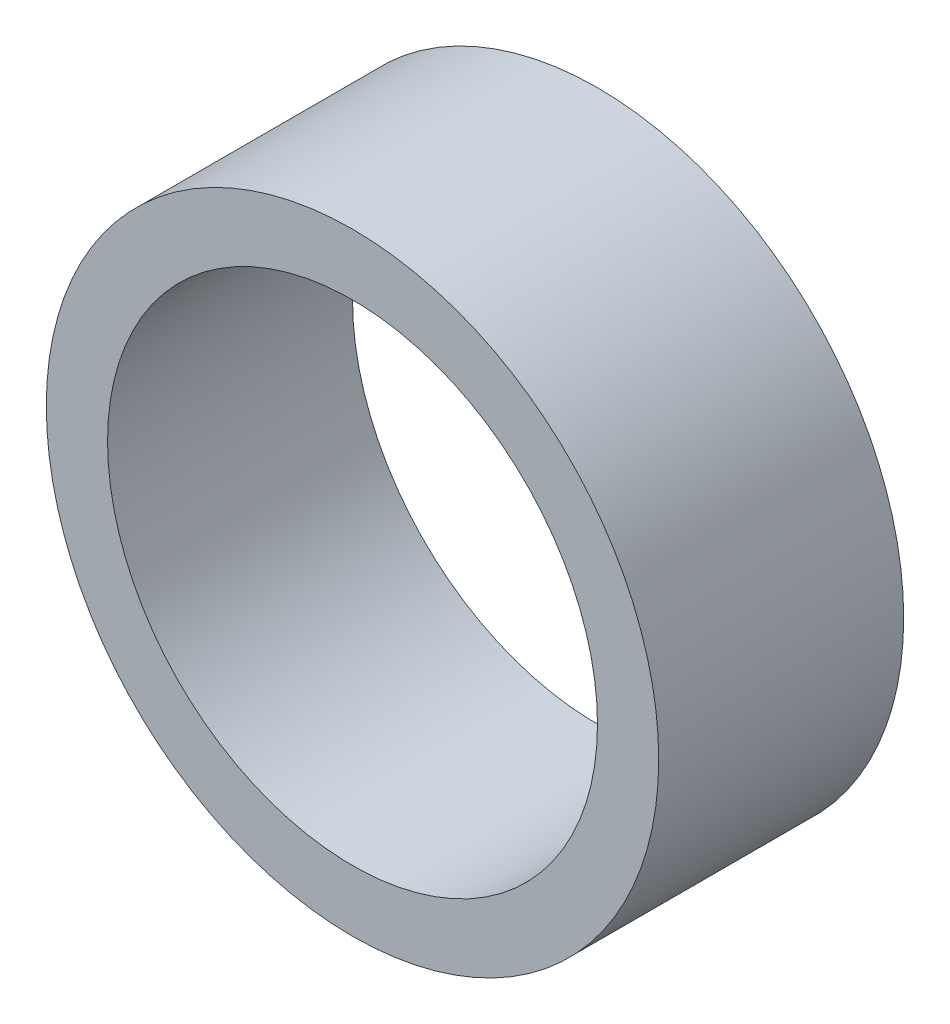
ISO-10303-21;
HEADER;
FILE_DESCRIPTION(('STEP AP214'),'2;1');
FILE_NAME('part.step','',(''),(''),'','','');
FILE_SCHEMA(('AUTOMOTIVE_DESIGN { 1 0 10303 214 1 1 1 1 }'));
ENDSEC;
DATA;
#1=APPLICATION_CONTEXT('core data for automotive mechanical design processes');
#2=APPLICATION_PROTOCOL_DEFINITION('international standard','automotive_design',2000,#1);
#3=PRODUCT_CONTEXT('',#1,'mechanical');
#4=PRODUCT('Part','Part','',(#3));
#5=PRODUCT_RELATED_PRODUCT_CATEGORY('part','',(#4));
#6=PRODUCT_DEFINITION_FORMATION('','',#4);
#7=PRODUCT_DEFINITION_CONTEXT('part definition',#1,'design');
#8=PRODUCT_DEFINITION('design','',#6,#7);
#9=PRODUCT_DEFINITION_SHAPE('','',#8);
#10=(LENGTH_UNIT() NAMED_UNIT(*) SI_UNIT(.MILLI.,.METRE.));
#11=(NAMED_UNIT(*) PLANE_ANGLE_UNIT() SI_UNIT($,.RADIAN.));
#12=(NAMED_UNIT(*) SI_UNIT($,.STERADIAN.) SOLID_ANGLE_UNIT());
#13=UNCERTAINTY_MEASURE_WITH_UNIT(LENGTH_MEASURE(1.E-05),#10,'distance_accuracy_value','');
#14=(GEOMETRIC_REPRESENTATION_CONTEXT(3) GLOBAL_UNCERTAINTY_ASSIGNED_CONTEXT((#13)) GLOBAL_UNIT_ASSIGNED_CONTEXT((#10,
#11,#12)) REPRESENTATION_CONTEXT('',''));
#15=CARTESIAN_POINT('',(0.,0.,0.));
#16=DIRECTION('',(0.,0.,1.));
#17=DIRECTION('',(1.,0.,0.));
#18=AXIS2_PLACEMENT_3D('',#15,#16,#17);
#19=CARTESIAN_POINT('',(0.,0.,6.));
#20=DIRECTION('',(0.,0.,-1.));
#21=DIRECTION('',(0.,1.,0.));
#22=AXIS2_PLACEMENT_3D('',#19,#20,#21);
#23=CYLINDRICAL_SURFACE('',#22,6.);
#24=CARTESIAN_POINT('',(0.,0.,6.));
#25=DIRECTION('',(0.,0.,-1.));
#26=DIRECTION('',(1.,0.,0.));
#27=AXIS2_PLACEMENT_3D('',#24,#25,#26);
#28=CIRCLE('',#27,6.);
#29=CARTESIAN_POINT('',(6.,0.,6.));
#30=VERTEX_POINT('',#29);
#31=EDGE_CURVE('E8',#30,#30,#28,.T.);
#32=ORIENTED_EDGE('',*,*,#31,.F.);
#33=EDGE_LOOP('',(#32));
#34=FACE_BOUND('',#33,.T.);
#35=CARTESIAN_POINT('',(0.,0.,0.));
#36=DIRECTION('',(0.,0.,-1.));
#37=DIRECTION('',(1.,0.,0.));
#38=AXIS2_PLACEMENT_3D('',#35,#36,#37);
#39=CIRCLE('',#38,6.);
#40=CARTESIAN_POINT('',(6.,0.,0.));
#41=VERTEX_POINT('',#40);
#42=EDGE_CURVE('E23',#41,#41,#39,.T.);
#43=ORIENTED_EDGE('',*,*,#42,.T.);
#44=EDGE_LOOP('',(#43));
#45=FACE_BOUND('',#44,.T.);
#46=ADVANCED_FACE('F12',(#34,#45),#23,.F.);
#47=CARTESIAN_POINT('',(0.,0.,6.));
#48=DIRECTION('',(0.,0.,-1.));
#49=DIRECTION('',(0.,1.,0.));
#50=AXIS2_PLACEMENT_3D('',#47,#48,#49);
#51=CYLINDRICAL_SURFACE('',#50,7.5);
#52=CARTESIAN_POINT('',(0.,0.,6.));
#53=DIRECTION('',(0.,0.,-1.));
#54=DIRECTION('',(1.,0.,0.));
#55=AXIS2_PLACEMENT_3D('',#52,#53,#54);
#56=CIRCLE('',#55,7.5);
#57=CARTESIAN_POINT('',(7.5,0.,6.));
#58=VERTEX_POINT('',#57);
#59=EDGE_CURVE('E19',#58,#58,#56,.T.);
#60=ORIENTED_EDGE('',*,*,#59,.T.);
#61=EDGE_LOOP('',(#60));
#62=FACE_BOUND('',#61,.T.);
#63=CARTESIAN_POINT('',(0.,0.,0.));
#64=DIRECTION('',(0.,0.,-1.));
#65=DIRECTION('',(1.,0.,0.));
#66=AXIS2_PLACEMENT_3D('',#63,#64,#65);
#67=CIRCLE('',#66,7.5);
#68=CARTESIAN_POINT('',(7.5,0.,0.));
#69=VERTEX_POINT('',#68);
#70=EDGE_CURVE('E28',#69,#69,#67,.T.);
#71=ORIENTED_EDGE('',*,*,#70,.F.);
#72=EDGE_LOOP('',(#71));
#73=FACE_BOUND('',#72,.T.);
#74=ADVANCED_FACE('F14',(#62,#73),#51,.T.);
#75=CARTESIAN_POINT('',(0.,0.,6.));
#76=DIRECTION('',(0.,0.,-1.));
#77=DIRECTION('',(0.,1.,0.));
#78=AXIS2_PLACEMENT_3D('',#75,#76,#77);
#79=PLANE('',#78);
#80=ORIENTED_EDGE('',*,*,#31,.T.);
#81=EDGE_LOOP('',(#80));
#82=FACE_BOUND('',#81,.T.);
#83=ORIENTED_EDGE('',*,*,#59,.F.);
#84=EDGE_LOOP('',(#83));
#85=FACE_BOUND('',#84,.T.);
#86=ADVANCED_FACE('F40',(#82,#85),#79,.F.);
#87=CARTESIAN_POINT('',(0.,0.,0.));
#88=DIRECTION('',(0.,0.,-1.));
#89=DIRECTION('',(0.,1.,0.));
#90=AXIS2_PLACEMENT_3D('',#87,#88,#89);
#91=PLANE('',#90);
#92=ORIENTED_EDGE('',*,*,#42,.F.);
#93=EDGE_LOOP('',(#92));
#94=FACE_BOUND('',#93,.T.);
#95=ORIENTED_EDGE('',*,*,#70,.T.);
#96=EDGE_LOOP('',(#95));
#97=FACE_BOUND('',#96,.T.);
#98=ADVANCED_FACE('F37',(#94,#97),#91,.T.);
#99=CLOSED_SHELL('',(#46,#74,#86,#98));
#100=MANIFOLD_SOLID_BREP('B1',#99);
#101=ADVANCED_BREP_SHAPE_REPRESENTATION('',(#18,#100),#14);
#102=SHAPE_DEFINITION_REPRESENTATION(#9,#101);
ENDSEC;
END-ISO-10303-21;
